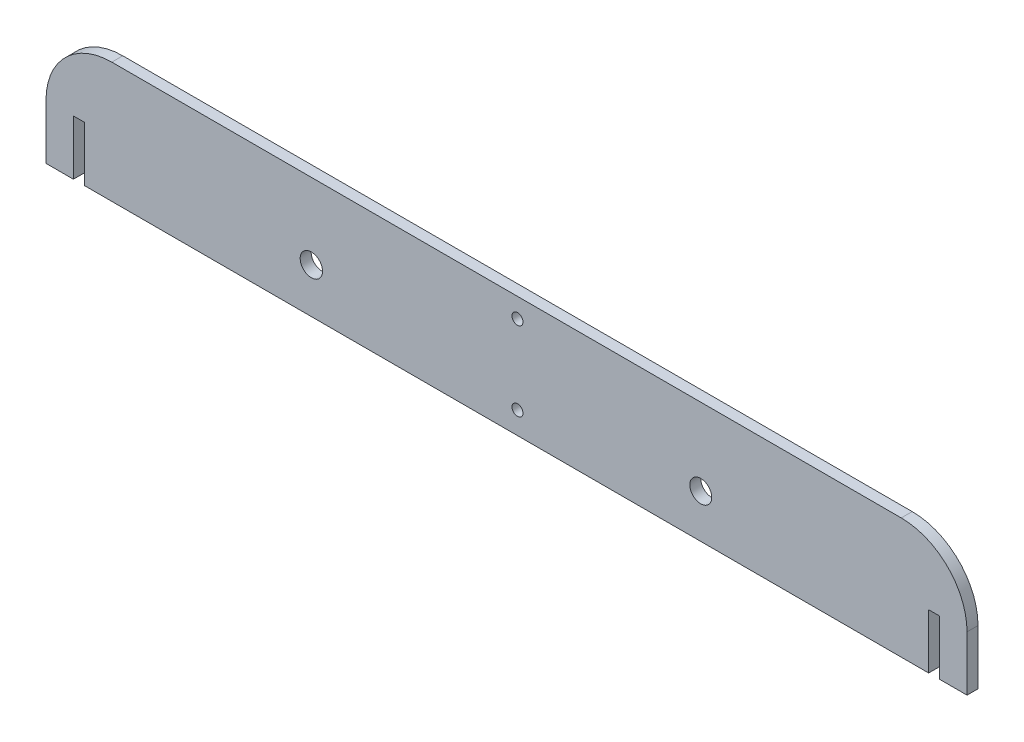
ISO-10303-21;
HEADER;
FILE_DESCRIPTION(('STEP AP214'),'2;1');
FILE_NAME('part.step','',(''),(''),'','','');
FILE_SCHEMA(('AUTOMOTIVE_DESIGN { 1 0 10303 214 1 1 1 1 }'));
ENDSEC;
DATA;
#1=APPLICATION_CONTEXT('core data for automotive mechanical design processes');
#2=APPLICATION_PROTOCOL_DEFINITION('international standard','automotive_design',2000,#1);
#3=PRODUCT_CONTEXT('',#1,'mechanical');
#4=PRODUCT('Part','Part','',(#3));
#5=PRODUCT_RELATED_PRODUCT_CATEGORY('part','',(#4));
#6=PRODUCT_DEFINITION_FORMATION('','',#4);
#7=PRODUCT_DEFINITION_CONTEXT('part definition',#1,'design');
#8=PRODUCT_DEFINITION('design','',#6,#7);
#9=PRODUCT_DEFINITION_SHAPE('','',#8);
#10=(LENGTH_UNIT() NAMED_UNIT(*) SI_UNIT(.MILLI.,.METRE.));
#11=(NAMED_UNIT(*) PLANE_ANGLE_UNIT() SI_UNIT($,.RADIAN.));
#12=(NAMED_UNIT(*) SI_UNIT($,.STERADIAN.) SOLID_ANGLE_UNIT());
#13=UNCERTAINTY_MEASURE_WITH_UNIT(LENGTH_MEASURE(1.E-05),#10,'distance_accuracy_value','');
#14=(GEOMETRIC_REPRESENTATION_CONTEXT(3) GLOBAL_UNCERTAINTY_ASSIGNED_CONTEXT((#13)) GLOBAL_UNIT_ASSIGNED_CONTEXT((#10,
#11,#12)) REPRESENTATION_CONTEXT('',''));
#15=CARTESIAN_POINT('',(0.,0.,0.));
#16=DIRECTION('',(0.,0.,1.));
#17=DIRECTION('',(1.,0.,0.));
#18=AXIS2_PLACEMENT_3D('',#15,#16,#17);
#19=CARTESIAN_POINT('',(210.,0.,2.5));
#20=DIRECTION('',(0.,1.,0.));
#21=DIRECTION('',(0.,0.,1.));
#22=AXIS2_PLACEMENT_3D('',#19,#20,#21);
#23=PLANE('',#22);
#24=DIRECTION('',(1.,0.,0.));
#25=VECTOR('',#24,1.);
#26=CARTESIAN_POINT('',(210.,0.,-2.5));
#27=LINE('',#26,#25);
#28=CARTESIAN_POINT('',(-210.,0.,-2.5));
#29=VERTEX_POINT('',#28);
#30=CARTESIAN_POINT('',(-197.5,0.,-2.5));
#31=VERTEX_POINT('',#30);
#32=EDGE_CURVE('E237',#29,#31,#27,.T.);
#33=ORIENTED_EDGE('',*,*,#32,.T.);
#34=DIRECTION('',(0.,0.,1.));
#35=VECTOR('',#34,1.);
#36=CARTESIAN_POINT('',(-197.5,0.,-2.5));
#37=LINE('',#36,#35);
#38=CARTESIAN_POINT('',(-197.5,0.,2.5));
#39=VERTEX_POINT('',#38);
#40=EDGE_CURVE('E196',#31,#39,#37,.T.);
#41=ORIENTED_EDGE('',*,*,#40,.T.);
#42=DIRECTION('',(1.,0.,0.));
#43=VECTOR('',#42,1.);
#44=CARTESIAN_POINT('',(210.,0.,2.5));
#45=LINE('',#44,#43);
#46=CARTESIAN_POINT('',(-210.,0.,2.5));
#47=VERTEX_POINT('',#46);
#48=EDGE_CURVE('E222',#47,#39,#45,.T.);
#49=ORIENTED_EDGE('',*,*,#48,.F.);
#50=DIRECTION('',(0.,0.,-1.));
#51=VECTOR('',#50,1.);
#52=CARTESIAN_POINT('',(-210.,0.,2.5));
#53=LINE('',#52,#51);
#54=EDGE_CURVE('E11',#47,#29,#53,.T.);
#55=ORIENTED_EDGE('',*,*,#54,.T.);
#56=EDGE_LOOP('',(#33,#41,#49,#55));
#57=FACE_BOUND('',#56,.T.);
#58=ADVANCED_FACE('F33',(#57),#23,.F.);
#59=CARTESIAN_POINT('',(197.5,0.,2.5));
#60=VERTEX_POINT('',#59);
#61=CARTESIAN_POINT('',(210.,0.,2.5));
#62=VERTEX_POINT('',#61);
#63=EDGE_CURVE('E220',#60,#62,#45,.T.);
#64=ORIENTED_EDGE('',*,*,#63,.F.);
#65=DIRECTION('',(0.,0.,1.));
#66=VECTOR('',#65,1.);
#67=CARTESIAN_POINT('',(197.5,0.,-2.5));
#68=LINE('',#67,#66);
#69=CARTESIAN_POINT('',(197.5,0.,-2.5));
#70=VERTEX_POINT('',#69);
#71=EDGE_CURVE('E169',#70,#60,#68,.T.);
#72=ORIENTED_EDGE('',*,*,#71,.F.);
#73=CARTESIAN_POINT('',(210.,0.,-2.5));
#74=VERTEX_POINT('',#73);
#75=EDGE_CURVE('E156',#70,#74,#27,.T.);
#76=ORIENTED_EDGE('',*,*,#75,.T.);
#77=DIRECTION('',(0.,0.,-1.));
#78=VECTOR('',#77,1.);
#79=CARTESIAN_POINT('',(210.,0.,2.5));
#80=LINE('',#79,#78);
#81=EDGE_CURVE('E41',#62,#74,#80,.T.);
#82=ORIENTED_EDGE('',*,*,#81,.F.);
#83=EDGE_LOOP('',(#64,#72,#76,#82));
#84=FACE_BOUND('',#83,.T.);
#85=ADVANCED_FACE('F292',(#84),#23,.F.);
#86=CARTESIAN_POINT('',(-210.,0.,2.5));
#87=DIRECTION('',(1.,0.,0.));
#88=DIRECTION('',(0.,0.,-1.));
#89=AXIS2_PLACEMENT_3D('',#86,#87,#88);
#90=PLANE('',#89);
#91=DIRECTION('',(0.,-1.,0.));
#92=VECTOR('',#91,1.);
#93=CARTESIAN_POINT('',(-210.,0.,-2.5));
#94=LINE('',#93,#92);
#95=CARTESIAN_POINT('',(-210.,25.,-2.5));
#96=VERTEX_POINT('',#95);
#97=EDGE_CURVE('E214',#96,#29,#94,.T.);
#98=ORIENTED_EDGE('',*,*,#97,.T.);
#99=ORIENTED_EDGE('',*,*,#54,.F.);
#100=DIRECTION('',(0.,-1.,0.));
#101=VECTOR('',#100,1.);
#102=CARTESIAN_POINT('',(-210.,0.,2.5));
#103=LINE('',#102,#101);
#104=CARTESIAN_POINT('',(-210.,25.,2.5));
#105=VERTEX_POINT('',#104);
#106=EDGE_CURVE('E217',#105,#47,#103,.T.);
#107=ORIENTED_EDGE('',*,*,#106,.F.);
#108=DIRECTION('',(0.,0.,-1.));
#109=VECTOR('',#108,1.);
#110=CARTESIAN_POINT('',(-210.,25.,2.5));
#111=LINE('',#110,#109);
#112=EDGE_CURVE('E234',#105,#96,#111,.T.);
#113=ORIENTED_EDGE('',*,*,#112,.T.);
#114=EDGE_LOOP('',(#98,#99,#107,#113));
#115=FACE_BOUND('',#114,.T.);
#116=ADVANCED_FACE('F35',(#115),#90,.F.);
#117=CARTESIAN_POINT('',(-192.5,0.,2.5));
#118=VERTEX_POINT('',#117);
#119=CARTESIAN_POINT('',(192.5,0.,2.5));
#120=VERTEX_POINT('',#119);
#121=EDGE_CURVE('E226',#118,#120,#45,.T.);
#122=ORIENTED_EDGE('',*,*,#121,.F.);
#123=DIRECTION('',(0.,0.,1.));
#124=VECTOR('',#123,1.);
#125=CARTESIAN_POINT('',(-192.5,0.,-2.5));
#126=LINE('',#125,#124);
#127=CARTESIAN_POINT('',(-192.5,0.,-2.5));
#128=VERTEX_POINT('',#127);
#129=EDGE_CURVE('E207',#128,#118,#126,.T.);
#130=ORIENTED_EDGE('',*,*,#129,.F.);
#131=CARTESIAN_POINT('',(192.5,0.,-2.5));
#132=VERTEX_POINT('',#131);
#133=EDGE_CURVE('E241',#128,#132,#27,.T.);
#134=ORIENTED_EDGE('',*,*,#133,.T.);
#135=DIRECTION('',(0.,0.,1.));
#136=VECTOR('',#135,1.);
#137=CARTESIAN_POINT('',(192.5,0.,-2.5));
#138=LINE('',#137,#136);
#139=EDGE_CURVE('E171',#132,#120,#138,.T.);
#140=ORIENTED_EDGE('',*,*,#139,.T.);
#141=EDGE_LOOP('',(#122,#130,#134,#140));
#142=FACE_BOUND('',#141,.T.);
#143=ADVANCED_FACE('F288',(#142),#23,.F.);
#144=CARTESIAN_POINT('',(210.,0.,2.5));
#145=DIRECTION('',(-1.,0.,0.));
#146=DIRECTION('',(0.,0.,1.));
#147=AXIS2_PLACEMENT_3D('',#144,#145,#146);
#148=PLANE('',#147);
#149=DIRECTION('',(0.,1.,0.));
#150=VECTOR('',#149,1.);
#151=CARTESIAN_POINT('',(210.,0.,-2.5));
#152=LINE('',#151,#150);
#153=CARTESIAN_POINT('',(210.,25.,-2.5));
#154=VERTEX_POINT('',#153);
#155=EDGE_CURVE('E240',#74,#154,#152,.T.);
#156=ORIENTED_EDGE('',*,*,#155,.T.);
#157=DIRECTION('',(0.,0.,-1.));
#158=VECTOR('',#157,1.);
#159=CARTESIAN_POINT('',(210.,25.,2.5));
#160=LINE('',#159,#158);
#161=CARTESIAN_POINT('',(210.,25.,2.5));
#162=VERTEX_POINT('',#161);
#163=EDGE_CURVE('E256',#162,#154,#160,.T.);
#164=ORIENTED_EDGE('',*,*,#163,.F.);
#165=DIRECTION('',(0.,1.,0.));
#166=VECTOR('',#165,1.);
#167=CARTESIAN_POINT('',(210.,0.,2.5));
#168=LINE('',#167,#166);
#169=EDGE_CURVE('E225',#62,#162,#168,.T.);
#170=ORIENTED_EDGE('',*,*,#169,.F.);
#171=ORIENTED_EDGE('',*,*,#81,.T.);
#172=EDGE_LOOP('',(#156,#164,#170,#171));
#173=FACE_BOUND('',#172,.T.);
#174=ADVANCED_FACE('F262',(#173),#148,.F.);
#175=CARTESIAN_POINT('',(180.,25.,2.5));
#176=DIRECTION('',(0.,0.,-1.));
#177=DIRECTION('',(-1.,0.,0.));
#178=AXIS2_PLACEMENT_3D('',#175,#176,#177);
#179=CYLINDRICAL_SURFACE('',#178,30.);
#180=CARTESIAN_POINT('',(180.,25.,-2.5));
#181=DIRECTION('',(0.,0.,1.));
#182=DIRECTION('',(1.,0.,0.));
#183=AXIS2_PLACEMENT_3D('',#180,#181,#182);
#184=CIRCLE('',#183,30.);
#185=CARTESIAN_POINT('',(180.,55.,-2.5));
#186=VERTEX_POINT('',#185);
#187=EDGE_CURVE('E243',#154,#186,#184,.T.);
#188=ORIENTED_EDGE('',*,*,#187,.T.);
#189=DIRECTION('',(0.,0.,-1.));
#190=VECTOR('',#189,1.);
#191=CARTESIAN_POINT('',(180.,55.,2.5));
#192=LINE('',#191,#190);
#193=CARTESIAN_POINT('',(180.,55.,2.5));
#194=VERTEX_POINT('',#193);
#195=EDGE_CURVE('E253',#194,#186,#192,.T.);
#196=ORIENTED_EDGE('',*,*,#195,.F.);
#197=CARTESIAN_POINT('',(180.,25.,2.5));
#198=DIRECTION('',(0.,0.,1.));
#199=DIRECTION('',(1.,0.,0.));
#200=AXIS2_PLACEMENT_3D('',#197,#198,#199);
#201=CIRCLE('',#200,30.);
#202=EDGE_CURVE('E228',#162,#194,#201,.T.);
#203=ORIENTED_EDGE('',*,*,#202,.F.);
#204=ORIENTED_EDGE('',*,*,#163,.T.);
#205=EDGE_LOOP('',(#188,#196,#203,#204));
#206=FACE_BOUND('',#205,.T.);
#207=ADVANCED_FACE('F271',(#206),#179,.T.);
#208=CARTESIAN_POINT('',(-180.,55.,2.5));
#209=DIRECTION('',(0.,-1.,0.));
#210=DIRECTION('',(0.,0.,-1.));
#211=AXIS2_PLACEMENT_3D('',#208,#209,#210);
#212=PLANE('',#211);
#213=DIRECTION('',(-1.,0.,0.));
#214=VECTOR('',#213,1.);
#215=CARTESIAN_POINT('',(-180.,55.,-2.5));
#216=LINE('',#215,#214);
#217=CARTESIAN_POINT('',(-180.,55.,-2.5));
#218=VERTEX_POINT('',#217);
#219=EDGE_CURVE('E245',#186,#218,#216,.T.);
#220=ORIENTED_EDGE('',*,*,#219,.T.);
#221=DIRECTION('',(0.,0.,-1.));
#222=VECTOR('',#221,1.);
#223=CARTESIAN_POINT('',(-180.,55.,2.5));
#224=LINE('',#223,#222);
#225=CARTESIAN_POINT('',(-180.,55.,2.5));
#226=VERTEX_POINT('',#225);
#227=EDGE_CURVE('E250',#226,#218,#224,.T.);
#228=ORIENTED_EDGE('',*,*,#227,.F.);
#229=DIRECTION('',(-1.,0.,0.));
#230=VECTOR('',#229,1.);
#231=CARTESIAN_POINT('',(-180.,55.,2.5));
#232=LINE('',#231,#230);
#233=EDGE_CURVE('E230',#194,#226,#232,.T.);
#234=ORIENTED_EDGE('',*,*,#233,.F.);
#235=ORIENTED_EDGE('',*,*,#195,.T.);
#236=EDGE_LOOP('',(#220,#228,#234,#235));
#237=FACE_BOUND('',#236,.T.);
#238=ADVANCED_FACE('F275',(#237),#212,.F.);
#239=CARTESIAN_POINT('',(-180.,25.,2.5));
#240=DIRECTION('',(0.,0.,-1.));
#241=DIRECTION('',(-1.,0.,0.));
#242=AXIS2_PLACEMENT_3D('',#239,#240,#241);
#243=CYLINDRICAL_SURFACE('',#242,30.);
#244=CARTESIAN_POINT('',(-180.,25.,-2.5));
#245=DIRECTION('',(0.,0.,1.));
#246=DIRECTION('',(-1.,0.,0.));
#247=AXIS2_PLACEMENT_3D('',#244,#245,#246);
#248=CIRCLE('',#247,30.);
#249=EDGE_CURVE('E221',#218,#96,#248,.T.);
#250=ORIENTED_EDGE('',*,*,#249,.T.);
#251=ORIENTED_EDGE('',*,*,#112,.F.);
#252=CARTESIAN_POINT('',(-180.,25.,2.5));
#253=DIRECTION('',(0.,0.,1.));
#254=DIRECTION('',(-1.,0.,0.));
#255=AXIS2_PLACEMENT_3D('',#252,#253,#254);
#256=CIRCLE('',#255,30.);
#257=EDGE_CURVE('E232',#226,#105,#256,.T.);
#258=ORIENTED_EDGE('',*,*,#257,.F.);
#259=ORIENTED_EDGE('',*,*,#227,.T.);
#260=EDGE_LOOP('',(#250,#251,#258,#259));
#261=FACE_BOUND('',#260,.T.);
#262=ADVANCED_FACE('F312',(#261),#243,.T.);
#263=CARTESIAN_POINT('',(-180.,25.,2.5));
#264=DIRECTION('',(0.,0.,-1.));
#265=DIRECTION('',(-1.,0.,0.));
#266=AXIS2_PLACEMENT_3D('',#263,#264,#265);
#267=PLANE('',#266);
#268=CARTESIAN_POINT('',(88.5802127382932,19.863618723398,2.5));
#269=DIRECTION('',(0.,0.,1.));
#270=DIRECTION('',(1.,0.,0.));
#271=AXIS2_PLACEMENT_3D('',#268,#269,#270);
#272=CIRCLE('',#271,5.);
#273=CARTESIAN_POINT('',(93.5802127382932,19.863618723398,2.5));
#274=VERTEX_POINT('',#273);
#275=EDGE_CURVE('E179',#274,#274,#272,.T.);
#276=ORIENTED_EDGE('',*,*,#275,.F.);
#277=EDGE_LOOP('',(#276));
#278=FACE_BOUND('',#277,.T.);
#279=CARTESIAN_POINT('',(5.00000000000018,10.1,2.5));
#280=DIRECTION('',(0.,0.,1.));
#281=DIRECTION('',(1.,0.,0.));
#282=AXIS2_PLACEMENT_3D('',#279,#280,#281);
#283=CIRCLE('',#282,2.5);
#284=CARTESIAN_POINT('',(7.50000000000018,10.1,2.5));
#285=VERTEX_POINT('',#284);
#286=EDGE_CURVE('E185',#285,#285,#283,.T.);
#287=ORIENTED_EDGE('',*,*,#286,.F.);
#288=EDGE_LOOP('',(#287));
#289=FACE_BOUND('',#288,.T.);
#290=CARTESIAN_POINT('',(5.00000000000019,46.0943713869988,2.5));
#291=DIRECTION('',(0.,0.,1.));
#292=DIRECTION('',(1.,0.,0.));
#293=AXIS2_PLACEMENT_3D('',#290,#291,#292);
#294=CIRCLE('',#293,2.50562861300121);
#295=CARTESIAN_POINT('',(7.5056286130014,46.0943713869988,2.5));
#296=VERTEX_POINT('',#295);
#297=EDGE_CURVE('E162',#296,#296,#294,.T.);
#298=ORIENTED_EDGE('',*,*,#297,.F.);
#299=EDGE_LOOP('',(#298));
#300=FACE_BOUND('',#299,.T.);
#301=CARTESIAN_POINT('',(-88.9999999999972,20.4413389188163,2.5));
#302=DIRECTION('',(0.,0.,1.));
#303=DIRECTION('',(1.,0.,0.));
#304=AXIS2_PLACEMENT_3D('',#301,#302,#303);
#305=CIRCLE('',#304,5.09331166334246);
#306=CARTESIAN_POINT('',(-83.9066883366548,20.4413389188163,2.5));
#307=VERTEX_POINT('',#306);
#308=EDGE_CURVE('E178',#307,#307,#305,.T.);
#309=ORIENTED_EDGE('',*,*,#308,.F.);
#310=EDGE_LOOP('',(#309));
#311=FACE_BOUND('',#310,.T.);
#312=ORIENTED_EDGE('',*,*,#48,.T.);
#313=DIRECTION('',(0.,-1.,0.));
#314=VECTOR('',#313,1.);
#315=CARTESIAN_POINT('',(-197.5,24.9999999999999,2.5));
#316=LINE('',#315,#314);
#317=CARTESIAN_POINT('',(-197.5,24.9999999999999,2.5));
#318=VERTEX_POINT('',#317);
#319=EDGE_CURVE('E197',#318,#39,#316,.T.);
#320=ORIENTED_EDGE('',*,*,#319,.F.);
#321=DIRECTION('',(-1.,0.,0.));
#322=VECTOR('',#321,1.);
#323=CARTESIAN_POINT('',(-197.5,24.9999999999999,2.5));
#324=LINE('',#323,#322);
#325=CARTESIAN_POINT('',(-192.5,24.9999999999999,2.5));
#326=VERTEX_POINT('',#325);
#327=EDGE_CURVE('E192',#326,#318,#324,.T.);
#328=ORIENTED_EDGE('',*,*,#327,.F.);
#329=DIRECTION('',(0.,1.,0.));
#330=VECTOR('',#329,1.);
#331=CARTESIAN_POINT('',(-192.5,24.9999999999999,2.5));
#332=LINE('',#331,#330);
#333=EDGE_CURVE('E199',#118,#326,#332,.T.);
#334=ORIENTED_EDGE('',*,*,#333,.F.);
#335=ORIENTED_EDGE('',*,*,#121,.T.);
#336=DIRECTION('',(0.,-1.,0.));
#337=VECTOR('',#336,1.);
#338=CARTESIAN_POINT('',(192.5,0.,2.5));
#339=LINE('',#338,#337);
#340=CARTESIAN_POINT('',(192.5,25.0000000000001,2.5));
#341=VERTEX_POINT('',#340);
#342=EDGE_CURVE('E157',#341,#120,#339,.T.);
#343=ORIENTED_EDGE('',*,*,#342,.F.);
#344=DIRECTION('',(-1.,0.,0.));
#345=VECTOR('',#344,1.);
#346=CARTESIAN_POINT('',(197.5,25.0000000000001,2.5));
#347=LINE('',#346,#345);
#348=CARTESIAN_POINT('',(197.5,25.0000000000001,2.5));
#349=VERTEX_POINT('',#348);
#350=EDGE_CURVE('E159',#349,#341,#347,.T.);
#351=ORIENTED_EDGE('',*,*,#350,.F.);
#352=DIRECTION('',(0.,1.,0.));
#353=VECTOR('',#352,1.);
#354=CARTESIAN_POINT('',(197.5,0.,2.5));
#355=LINE('',#354,#353);
#356=EDGE_CURVE('E140',#60,#349,#355,.T.);
#357=ORIENTED_EDGE('',*,*,#356,.F.);
#358=ORIENTED_EDGE('',*,*,#63,.T.);
#359=ORIENTED_EDGE('',*,*,#169,.T.);
#360=ORIENTED_EDGE('',*,*,#202,.T.);
#361=ORIENTED_EDGE('',*,*,#233,.T.);
#362=ORIENTED_EDGE('',*,*,#257,.T.);
#363=ORIENTED_EDGE('',*,*,#106,.T.);
#364=EDGE_LOOP('',(#312,#320,#328,#334,#335,#343,#351,#357,#358,#359,#360,#361,#362,#363));
#365=FACE_BOUND('',#364,.T.);
#366=ADVANCED_FACE('F279',(#278,#289,#300,#311,#365),#267,.F.);
#367=CARTESIAN_POINT('',(-180.,25.,-2.5));
#368=DIRECTION('',(0.,0.,-1.));
#369=DIRECTION('',(-1.,0.,0.));
#370=AXIS2_PLACEMENT_3D('',#367,#368,#369);
#371=PLANE('',#370);
#372=DIRECTION('',(0.,-1.,0.));
#373=VECTOR('',#372,1.);
#374=CARTESIAN_POINT('',(-197.5,24.9999999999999,-2.5));
#375=LINE('',#374,#373);
#376=CARTESIAN_POINT('',(-197.5,24.9999999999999,-2.5));
#377=VERTEX_POINT('',#376);
#378=EDGE_CURVE('E189',#377,#31,#375,.T.);
#379=ORIENTED_EDGE('',*,*,#378,.T.);
#380=ORIENTED_EDGE('',*,*,#32,.F.);
#381=ORIENTED_EDGE('',*,*,#97,.F.);
#382=ORIENTED_EDGE('',*,*,#249,.F.);
#383=ORIENTED_EDGE('',*,*,#219,.F.);
#384=ORIENTED_EDGE('',*,*,#187,.F.);
#385=ORIENTED_EDGE('',*,*,#155,.F.);
#386=ORIENTED_EDGE('',*,*,#75,.F.);
#387=DIRECTION('',(0.,1.,0.));
#388=VECTOR('',#387,1.);
#389=CARTESIAN_POINT('',(197.5,0.,-2.5));
#390=LINE('',#389,#388);
#391=CARTESIAN_POINT('',(197.5,25.0000000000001,-2.5));
#392=VERTEX_POINT('',#391);
#393=EDGE_CURVE('E137',#70,#392,#390,.T.);
#394=ORIENTED_EDGE('',*,*,#393,.T.);
#395=DIRECTION('',(-1.,0.,0.));
#396=VECTOR('',#395,1.);
#397=CARTESIAN_POINT('',(197.5,25.0000000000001,-2.5));
#398=LINE('',#397,#396);
#399=CARTESIAN_POINT('',(192.5,25.0000000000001,-2.5));
#400=VERTEX_POINT('',#399);
#401=EDGE_CURVE('E147',#392,#400,#398,.T.);
#402=ORIENTED_EDGE('',*,*,#401,.T.);
#403=DIRECTION('',(0.,-1.,0.));
#404=VECTOR('',#403,1.);
#405=CARTESIAN_POINT('',(192.5,0.,-2.5));
#406=LINE('',#405,#404);
#407=EDGE_CURVE('E56',#400,#132,#406,.T.);
#408=ORIENTED_EDGE('',*,*,#407,.T.);
#409=ORIENTED_EDGE('',*,*,#133,.F.);
#410=DIRECTION('',(0.,1.,0.));
#411=VECTOR('',#410,1.);
#412=CARTESIAN_POINT('',(-192.5,24.9999999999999,-2.5));
#413=LINE('',#412,#411);
#414=CARTESIAN_POINT('',(-192.5,24.9999999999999,-2.5));
#415=VERTEX_POINT('',#414);
#416=EDGE_CURVE('E191',#128,#415,#413,.T.);
#417=ORIENTED_EDGE('',*,*,#416,.T.);
#418=DIRECTION('',(-1.,0.,0.));
#419=VECTOR('',#418,1.);
#420=CARTESIAN_POINT('',(-197.5,24.9999999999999,-2.5));
#421=LINE('',#420,#419);
#422=EDGE_CURVE('E48',#415,#377,#421,.T.);
#423=ORIENTED_EDGE('',*,*,#422,.T.);
#424=EDGE_LOOP('',(#379,#380,#381,#382,#383,#384,#385,#386,#394,#402,#408,#409,#417,#423));
#425=FACE_BOUND('',#424,.T.);
#426=CARTESIAN_POINT('',(88.5802127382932,19.863618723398,-2.5));
#427=DIRECTION('',(0.,0.,1.));
#428=DIRECTION('',(1.,0.,0.));
#429=AXIS2_PLACEMENT_3D('',#426,#427,#428);
#430=CIRCLE('',#429,5.);
#431=CARTESIAN_POINT('',(93.5802127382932,19.863618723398,-2.5));
#432=VERTEX_POINT('',#431);
#433=EDGE_CURVE('E175',#432,#432,#430,.T.);
#434=ORIENTED_EDGE('',*,*,#433,.T.);
#435=EDGE_LOOP('',(#434));
#436=FACE_BOUND('',#435,.T.);
#437=CARTESIAN_POINT('',(5.00000000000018,10.1,-2.5));
#438=DIRECTION('',(0.,0.,1.));
#439=DIRECTION('',(1.,0.,0.));
#440=AXIS2_PLACEMENT_3D('',#437,#438,#439);
#441=CIRCLE('',#440,2.5);
#442=CARTESIAN_POINT('',(7.50000000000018,10.1,-2.5));
#443=VERTEX_POINT('',#442);
#444=EDGE_CURVE('E182',#443,#443,#441,.T.);
#445=ORIENTED_EDGE('',*,*,#444,.T.);
#446=EDGE_LOOP('',(#445));
#447=FACE_BOUND('',#446,.T.);
#448=CARTESIAN_POINT('',(5.00000000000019,46.0943713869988,-2.5));
#449=DIRECTION('',(0.,0.,1.));
#450=DIRECTION('',(1.,0.,0.));
#451=AXIS2_PLACEMENT_3D('',#448,#449,#450);
#452=CIRCLE('',#451,2.50562861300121);
#453=CARTESIAN_POINT('',(7.5056286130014,46.0943713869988,-2.5));
#454=VERTEX_POINT('',#453);
#455=EDGE_CURVE('E188',#454,#454,#452,.T.);
#456=ORIENTED_EDGE('',*,*,#455,.T.);
#457=EDGE_LOOP('',(#456));
#458=FACE_BOUND('',#457,.T.);
#459=CARTESIAN_POINT('',(-88.9999999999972,20.4413389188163,-2.5));
#460=DIRECTION('',(0.,0.,1.));
#461=DIRECTION('',(1.,0.,0.));
#462=AXIS2_PLACEMENT_3D('',#459,#460,#461);
#463=CIRCLE('',#462,5.09331166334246);
#464=CARTESIAN_POINT('',(-83.9066883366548,20.4413389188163,-2.5));
#465=VERTEX_POINT('',#464);
#466=EDGE_CURVE('E211',#465,#465,#463,.T.);
#467=ORIENTED_EDGE('',*,*,#466,.T.);
#468=EDGE_LOOP('',(#467));
#469=FACE_BOUND('',#468,.T.);
#470=ADVANCED_FACE('F153',(#425,#436,#447,#458,#469),#371,.T.);
#471=CARTESIAN_POINT('',(-88.9999999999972,20.4413389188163,-2.5));
#472=DIRECTION('',(0.,0.,1.));
#473=DIRECTION('',(1.,0.,0.));
#474=AXIS2_PLACEMENT_3D('',#471,#472,#473);
#475=CYLINDRICAL_SURFACE('',#474,5.09331166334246);
#476=ORIENTED_EDGE('',*,*,#466,.F.);
#477=EDGE_LOOP('',(#476));
#478=FACE_BOUND('',#477,.T.);
#479=ORIENTED_EDGE('',*,*,#308,.T.);
#480=EDGE_LOOP('',(#479));
#481=FACE_BOUND('',#480,.T.);
#482=ADVANCED_FACE('F318',(#478,#481),#475,.F.);
#483=CARTESIAN_POINT('',(197.5,0.,-2.5));
#484=DIRECTION('',(1.,0.,0.));
#485=DIRECTION('',(0.,0.,-1.));
#486=AXIS2_PLACEMENT_3D('',#483,#484,#485);
#487=PLANE('',#486);
#488=ORIENTED_EDGE('',*,*,#356,.T.);
#489=DIRECTION('',(0.,0.,1.));
#490=VECTOR('',#489,1.);
#491=CARTESIAN_POINT('',(197.5,25.0000000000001,-2.5));
#492=LINE('',#491,#490);
#493=EDGE_CURVE('E133',#392,#349,#492,.T.);
#494=ORIENTED_EDGE('',*,*,#493,.F.);
#495=ORIENTED_EDGE('',*,*,#393,.F.);
#496=ORIENTED_EDGE('',*,*,#71,.T.);
#497=EDGE_LOOP('',(#488,#494,#495,#496));
#498=FACE_BOUND('',#497,.T.);
#499=ADVANCED_FACE('F135',(#498),#487,.F.);
#500=CARTESIAN_POINT('',(192.5,0.,-2.5));
#501=DIRECTION('',(-1.,0.,0.));
#502=DIRECTION('',(0.,0.,1.));
#503=AXIS2_PLACEMENT_3D('',#500,#501,#502);
#504=PLANE('',#503);
#505=ORIENTED_EDGE('',*,*,#342,.T.);
#506=ORIENTED_EDGE('',*,*,#139,.F.);
#507=ORIENTED_EDGE('',*,*,#407,.F.);
#508=DIRECTION('',(0.,0.,1.));
#509=VECTOR('',#508,1.);
#510=CARTESIAN_POINT('',(192.5,25.0000000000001,-2.5));
#511=LINE('',#510,#509);
#512=EDGE_CURVE('E144',#400,#341,#511,.T.);
#513=ORIENTED_EDGE('',*,*,#512,.T.);
#514=EDGE_LOOP('',(#505,#506,#507,#513));
#515=FACE_BOUND('',#514,.T.);
#516=ADVANCED_FACE('F291',(#515),#504,.F.);
#517=CARTESIAN_POINT('',(197.5,25.0000000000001,-2.5));
#518=DIRECTION('',(0.,1.,0.));
#519=DIRECTION('',(0.,0.,1.));
#520=AXIS2_PLACEMENT_3D('',#517,#518,#519);
#521=PLANE('',#520);
#522=ORIENTED_EDGE('',*,*,#350,.T.);
#523=ORIENTED_EDGE('',*,*,#512,.F.);
#524=ORIENTED_EDGE('',*,*,#401,.F.);
#525=ORIENTED_EDGE('',*,*,#493,.T.);
#526=EDGE_LOOP('',(#522,#523,#524,#525));
#527=FACE_BOUND('',#526,.T.);
#528=ADVANCED_FACE('F148',(#527),#521,.F.);
#529=CARTESIAN_POINT('',(5.00000000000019,46.0943713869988,-2.5));
#530=DIRECTION('',(0.,0.,1.));
#531=DIRECTION('',(1.,0.,0.));
#532=AXIS2_PLACEMENT_3D('',#529,#530,#531);
#533=CYLINDRICAL_SURFACE('',#532,2.50562861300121);
#534=ORIENTED_EDGE('',*,*,#455,.F.);
#535=EDGE_LOOP('',(#534));
#536=FACE_BOUND('',#535,.T.);
#537=ORIENTED_EDGE('',*,*,#297,.T.);
#538=EDGE_LOOP('',(#537));
#539=FACE_BOUND('',#538,.T.);
#540=ADVANCED_FACE('F340',(#536,#539),#533,.F.);
#541=CARTESIAN_POINT('',(5.00000000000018,10.1,-2.5));
#542=DIRECTION('',(0.,0.,1.));
#543=DIRECTION('',(1.,0.,0.));
#544=AXIS2_PLACEMENT_3D('',#541,#542,#543);
#545=CYLINDRICAL_SURFACE('',#544,2.5);
#546=ORIENTED_EDGE('',*,*,#444,.F.);
#547=EDGE_LOOP('',(#546));
#548=FACE_BOUND('',#547,.T.);
#549=ORIENTED_EDGE('',*,*,#286,.T.);
#550=EDGE_LOOP('',(#549));
#551=FACE_BOUND('',#550,.T.);
#552=ADVANCED_FACE('F337',(#548,#551),#545,.F.);
#553=CARTESIAN_POINT('',(88.5802127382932,19.863618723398,-2.5));
#554=DIRECTION('',(0.,0.,1.));
#555=DIRECTION('',(1.,0.,0.));
#556=AXIS2_PLACEMENT_3D('',#553,#554,#555);
#557=CYLINDRICAL_SURFACE('',#556,5.);
#558=ORIENTED_EDGE('',*,*,#433,.F.);
#559=EDGE_LOOP('',(#558));
#560=FACE_BOUND('',#559,.T.);
#561=ORIENTED_EDGE('',*,*,#275,.T.);
#562=EDGE_LOOP('',(#561));
#563=FACE_BOUND('',#562,.T.);
#564=ADVANCED_FACE('F329',(#560,#563),#557,.F.);
#565=CARTESIAN_POINT('',(-197.5,24.9999999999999,-2.5));
#566=DIRECTION('',(-1.,0.,0.));
#567=DIRECTION('',(0.,0.,1.));
#568=AXIS2_PLACEMENT_3D('',#565,#566,#567);
#569=PLANE('',#568);
#570=ORIENTED_EDGE('',*,*,#319,.T.);
#571=ORIENTED_EDGE('',*,*,#40,.F.);
#572=ORIENTED_EDGE('',*,*,#378,.F.);
#573=DIRECTION('',(0.,0.,1.));
#574=VECTOR('',#573,1.);
#575=CARTESIAN_POINT('',(-197.5,24.9999999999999,-2.5));
#576=LINE('',#575,#574);
#577=EDGE_CURVE('E167',#377,#318,#576,.T.);
#578=ORIENTED_EDGE('',*,*,#577,.T.);
#579=EDGE_LOOP('',(#570,#571,#572,#578));
#580=FACE_BOUND('',#579,.T.);
#581=ADVANCED_FACE('F325',(#580),#569,.F.);
#582=CARTESIAN_POINT('',(-197.5,24.9999999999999,-2.5));
#583=DIRECTION('',(0.,1.,0.));
#584=DIRECTION('',(0.,0.,1.));
#585=AXIS2_PLACEMENT_3D('',#582,#583,#584);
#586=PLANE('',#585);
#587=ORIENTED_EDGE('',*,*,#327,.T.);
#588=ORIENTED_EDGE('',*,*,#577,.F.);
#589=ORIENTED_EDGE('',*,*,#422,.F.);
#590=DIRECTION('',(0.,0.,1.));
#591=VECTOR('',#590,1.);
#592=CARTESIAN_POINT('',(-192.5,24.9999999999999,-2.5));
#593=LINE('',#592,#591);
#594=EDGE_CURVE('E205',#415,#326,#593,.T.);
#595=ORIENTED_EDGE('',*,*,#594,.T.);
#596=EDGE_LOOP('',(#587,#588,#589,#595));
#597=FACE_BOUND('',#596,.T.);
#598=ADVANCED_FACE('F328',(#597),#586,.F.);
#599=CARTESIAN_POINT('',(-192.5,24.9999999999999,-2.5));
#600=DIRECTION('',(1.,0.,0.));
#601=DIRECTION('',(0.,0.,-1.));
#602=AXIS2_PLACEMENT_3D('',#599,#600,#601);
#603=PLANE('',#602);
#604=ORIENTED_EDGE('',*,*,#333,.T.);
#605=ORIENTED_EDGE('',*,*,#594,.F.);
#606=ORIENTED_EDGE('',*,*,#416,.F.);
#607=ORIENTED_EDGE('',*,*,#129,.T.);
#608=EDGE_LOOP('',(#604,#605,#606,#607));
#609=FACE_BOUND('',#608,.T.);
#610=ADVANCED_FACE('F331',(#609),#603,.F.);
#611=CLOSED_SHELL('',(#58,#85,#116,#143,#174,#207,#238,#262,#366,#470,#482,#499,#516,#528,#540,
#552,#564,#581,#598,#610));
#612=MANIFOLD_SOLID_BREP('B2',#611);
#613=ADVANCED_BREP_SHAPE_REPRESENTATION('',(#18,#612),#14);
#614=SHAPE_DEFINITION_REPRESENTATION(#9,#613);
ENDSEC;
END-ISO-10303-21;
